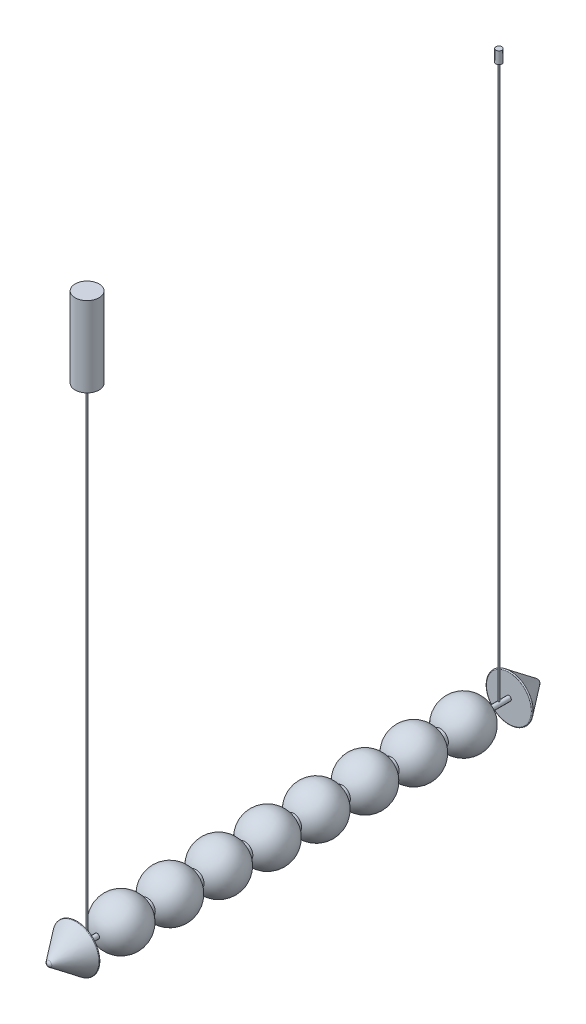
ISO-10303-21;
HEADER;
FILE_DESCRIPTION(('STEP AP214'),'2;1');
FILE_NAME('part.step','',(''),(''),'','','');
FILE_SCHEMA(('AUTOMOTIVE_DESIGN { 1 0 10303 214 1 1 1 1 }'));
ENDSEC;
DATA;
#1=APPLICATION_CONTEXT('core data for automotive mechanical design processes');
#2=APPLICATION_PROTOCOL_DEFINITION('international standard','automotive_design',2000,#1);
#3=PRODUCT_CONTEXT('',#1,'mechanical');
#4=PRODUCT('Part','Part','',(#3));
#5=PRODUCT_RELATED_PRODUCT_CATEGORY('part','',(#4));
#6=PRODUCT_DEFINITION_FORMATION('','',#4);
#7=PRODUCT_DEFINITION_CONTEXT('part definition',#1,'design');
#8=PRODUCT_DEFINITION('design','',#6,#7);
#9=PRODUCT_DEFINITION_SHAPE('','',#8);
#10=(LENGTH_UNIT() NAMED_UNIT(*) SI_UNIT(.MILLI.,.METRE.));
#11=(NAMED_UNIT(*) PLANE_ANGLE_UNIT() SI_UNIT($,.RADIAN.));
#12=(NAMED_UNIT(*) SI_UNIT($,.STERADIAN.) SOLID_ANGLE_UNIT());
#13=UNCERTAINTY_MEASURE_WITH_UNIT(LENGTH_MEASURE(1.E-05),#10,'distance_accuracy_value','');
#14=(GEOMETRIC_REPRESENTATION_CONTEXT(3) GLOBAL_UNCERTAINTY_ASSIGNED_CONTEXT((#13)) GLOBAL_UNIT_ASSIGNED_CONTEXT((#10,
#11,#12)) REPRESENTATION_CONTEXT('',''));
#15=CARTESIAN_POINT('',(0.,0.,0.));
#16=DIRECTION('',(0.,0.,1.));
#17=DIRECTION('',(1.,0.,0.));
#18=AXIS2_PLACEMENT_3D('',#15,#16,#17);
#19=CARTESIAN_POINT('',(0.,1420.,-1055.));
#20=DIRECTION('',(0.,-1.,0.));
#21=DIRECTION('',(0.,0.,-1.));
#22=AXIS2_PLACEMENT_3D('',#19,#20,#21);
#23=CYLINDRICAL_SURFACE('',#22,7.49999999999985);
#24=CARTESIAN_POINT('',(0.,1420.,-1055.));
#25=DIRECTION('',(0.,1.,0.));
#26=DIRECTION('',(0.,0.,1.));
#27=AXIS2_PLACEMENT_3D('',#24,#25,#26);
#28=CIRCLE('',#27,7.49999999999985);
#29=CARTESIAN_POINT('',(0.,1420.,-1047.5));
#30=VERTEX_POINT('',#29);
#31=EDGE_CURVE('E11',#30,#30,#28,.T.);
#32=ORIENTED_EDGE('',*,*,#31,.F.);
#33=EDGE_LOOP('',(#32));
#34=FACE_BOUND('',#33,.T.);
#35=CARTESIAN_POINT('',(0.,1390.,-1055.));
#36=DIRECTION('',(0.,1.,0.));
#37=DIRECTION('',(0.,0.,1.));
#38=AXIS2_PLACEMENT_3D('',#35,#36,#37);
#39=CIRCLE('',#38,7.49999999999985);
#40=CARTESIAN_POINT('',(0.,1390.,-1047.5));
#41=VERTEX_POINT('',#40);
#42=EDGE_CURVE('E42',#41,#41,#39,.T.);
#43=ORIENTED_EDGE('',*,*,#42,.T.);
#44=EDGE_LOOP('',(#43));
#45=FACE_BOUND('',#44,.T.);
#46=ADVANCED_FACE('F39',(#34,#45),#23,.T.);
#47=CARTESIAN_POINT('',(0.,1420.,-1055.));
#48=DIRECTION('',(0.,1.,0.));
#49=DIRECTION('',(0.,0.,1.));
#50=AXIS2_PLACEMENT_3D('',#47,#48,#49);
#51=PLANE('',#50);
#52=ORIENTED_EDGE('',*,*,#31,.T.);
#53=EDGE_LOOP('',(#52));
#54=FACE_BOUND('',#53,.T.);
#55=ADVANCED_FACE('F54',(#54),#51,.T.);
#56=CARTESIAN_POINT('',(0.,1390.,-1055.));
#57=DIRECTION('',(0.,1.,0.));
#58=DIRECTION('',(0.,0.,1.));
#59=AXIS2_PLACEMENT_3D('',#56,#57,#58);
#60=PLANE('',#59);
#61=ORIENTED_EDGE('',*,*,#42,.F.);
#62=EDGE_LOOP('',(#61));
#63=FACE_BOUND('',#62,.T.);
#64=ADVANCED_FACE('F52',(#63),#60,.F.);
#65=CLOSED_SHELL('',(#46,#55,#64));
#66=MANIFOLD_SOLID_BREP('B2',#65);
#67=CARTESIAN_POINT('',(0.,1410.,-25.));
#68=DIRECTION('',(0.,-1.,0.));
#69=DIRECTION('',(0.,0.,-1.));
#70=AXIS2_PLACEMENT_3D('',#67,#68,#69);
#71=CYLINDRICAL_SURFACE('',#70,30.);
#72=CARTESIAN_POINT('',(0.,1410.,-25.));
#73=DIRECTION('',(0.,1.,0.));
#74=DIRECTION('',(0.,0.,1.));
#75=AXIS2_PLACEMENT_3D('',#72,#73,#74);
#76=CIRCLE('',#75,30.);
#77=CARTESIAN_POINT('',(0.,1410.,5.));
#78=VERTEX_POINT('',#77);
#79=EDGE_CURVE('E38',#78,#78,#76,.T.);
#80=ORIENTED_EDGE('',*,*,#79,.F.);
#81=EDGE_LOOP('',(#80));
#82=FACE_BOUND('',#81,.T.);
#83=CARTESIAN_POINT('',(0.,1210.,-25.));
#84=DIRECTION('',(0.,1.,0.));
#85=DIRECTION('',(0.,0.,1.));
#86=AXIS2_PLACEMENT_3D('',#83,#84,#85);
#87=CIRCLE('',#86,30.);
#88=CARTESIAN_POINT('',(0.,1210.,5.));
#89=VERTEX_POINT('',#88);
#90=EDGE_CURVE('E90',#89,#89,#87,.T.);
#91=ORIENTED_EDGE('',*,*,#90,.T.);
#92=EDGE_LOOP('',(#91));
#93=FACE_BOUND('',#92,.T.);
#94=ADVANCED_FACE('F87',(#82,#93),#71,.T.);
#95=CARTESIAN_POINT('',(0.,1410.,-25.));
#96=DIRECTION('',(0.,1.,0.));
#97=DIRECTION('',(0.,0.,1.));
#98=AXIS2_PLACEMENT_3D('',#95,#96,#97);
#99=PLANE('',#98);
#100=ORIENTED_EDGE('',*,*,#79,.T.);
#101=EDGE_LOOP('',(#100));
#102=FACE_BOUND('',#101,.T.);
#103=ADVANCED_FACE('F102',(#102),#99,.T.);
#104=CARTESIAN_POINT('',(0.,1210.,-25.));
#105=DIRECTION('',(0.,1.,0.));
#106=DIRECTION('',(0.,0.,1.));
#107=AXIS2_PLACEMENT_3D('',#104,#105,#106);
#108=PLANE('',#107);
#109=ORIENTED_EDGE('',*,*,#90,.F.);
#110=EDGE_LOOP('',(#109));
#111=FACE_BOUND('',#110,.T.);
#112=ADVANCED_FACE('F100',(#111),#108,.F.);
#113=CLOSED_SHELL('',(#94,#103,#112));
#114=MANIFOLD_SOLID_BREP('B6',#113);
#115=CARTESIAN_POINT('',(0.,1210.,-25.));
#116=DIRECTION('',(0.,-1.,0.));
#117=DIRECTION('',(0.,0.,-1.));
#118=AXIS2_PLACEMENT_3D('',#115,#116,#117);
#119=CYLINDRICAL_SURFACE('',#118,5.);
#120=CARTESIAN_POINT('',(0.,1210.,-25.));
#121=DIRECTION('',(0.,1.,0.));
#122=DIRECTION('',(0.,0.,1.));
#123=AXIS2_PLACEMENT_3D('',#120,#121,#122);
#124=CIRCLE('',#123,5.);
#125=CARTESIAN_POINT('',(0.,1210.,-20.));
#126=VERTEX_POINT('',#125);
#127=EDGE_CURVE('E86',#126,#126,#124,.T.);
#128=ORIENTED_EDGE('',*,*,#127,.F.);
#129=EDGE_LOOP('',(#128));
#130=FACE_BOUND('',#129,.T.);
#131=CARTESIAN_POINT('',(0.,1200.,-25.));
#132=DIRECTION('',(0.,1.,0.));
#133=DIRECTION('',(0.,0.,1.));
#134=AXIS2_PLACEMENT_3D('',#131,#132,#133);
#135=CIRCLE('',#134,5.);
#136=CARTESIAN_POINT('',(0.,1200.,-20.));
#137=VERTEX_POINT('',#136);
#138=EDGE_CURVE('E138',#137,#137,#135,.T.);
#139=ORIENTED_EDGE('',*,*,#138,.T.);
#140=EDGE_LOOP('',(#139));
#141=FACE_BOUND('',#140,.T.);
#142=ADVANCED_FACE('F135',(#130,#141),#119,.T.);
#143=CARTESIAN_POINT('',(0.,1210.,-25.));
#144=DIRECTION('',(0.,1.,0.));
#145=DIRECTION('',(0.,0.,1.));
#146=AXIS2_PLACEMENT_3D('',#143,#144,#145);
#147=PLANE('',#146);
#148=ORIENTED_EDGE('',*,*,#127,.T.);
#149=EDGE_LOOP('',(#148));
#150=FACE_BOUND('',#149,.T.);
#151=ADVANCED_FACE('F150',(#150),#147,.T.);
#152=CARTESIAN_POINT('',(0.,1200.,-25.));
#153=DIRECTION('',(0.,1.,0.));
#154=DIRECTION('',(0.,0.,1.));
#155=AXIS2_PLACEMENT_3D('',#152,#153,#154);
#156=PLANE('',#155);
#157=ORIENTED_EDGE('',*,*,#138,.F.);
#158=EDGE_LOOP('',(#157));
#159=FACE_BOUND('',#158,.T.);
#160=ADVANCED_FACE('F148',(#159),#156,.F.);
#161=CLOSED_SHELL('',(#142,#151,#160));
#162=MANIFOLD_SOLID_BREP('B33',#161);
#163=CARTESIAN_POINT('',(0.,1390.,-1055.));
#164=DIRECTION('',(0.,-1.,0.));
#165=DIRECTION('',(0.,0.,-1.));
#166=AXIS2_PLACEMENT_3D('',#163,#164,#165);
#167=CYLINDRICAL_SURFACE('',#166,1.49999999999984);
#168=CARTESIAN_POINT('',(0.,1390.,-1055.));
#169=DIRECTION('',(0.,1.,0.));
#170=DIRECTION('',(0.,0.,1.));
#171=AXIS2_PLACEMENT_3D('',#168,#169,#170);
#172=CIRCLE('',#171,1.49999999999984);
#173=CARTESIAN_POINT('',(0.,1390.,-1053.5));
#174=VERTEX_POINT('',#173);
#175=EDGE_CURVE('E134',#174,#174,#172,.T.);
#176=ORIENTED_EDGE('',*,*,#175,.F.);
#177=EDGE_LOOP('',(#176));
#178=FACE_BOUND('',#177,.T.);
#179=CARTESIAN_POINT('',(0.,0.,-1055.));
#180=DIRECTION('',(0.,1.,0.));
#181=DIRECTION('',(0.,0.,1.));
#182=AXIS2_PLACEMENT_3D('',#179,#180,#181);
#183=CIRCLE('',#182,1.49999999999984);
#184=CARTESIAN_POINT('',(0.,0.,-1053.5));
#185=VERTEX_POINT('',#184);
#186=EDGE_CURVE('E186',#185,#185,#183,.T.);
#187=ORIENTED_EDGE('',*,*,#186,.T.);
#188=EDGE_LOOP('',(#187));
#189=FACE_BOUND('',#188,.T.);
#190=ADVANCED_FACE('F183',(#178,#189),#167,.T.);
#191=CARTESIAN_POINT('',(0.,1390.,-1055.));
#192=DIRECTION('',(0.,1.,0.));
#193=DIRECTION('',(0.,0.,1.));
#194=AXIS2_PLACEMENT_3D('',#191,#192,#193);
#195=PLANE('',#194);
#196=ORIENTED_EDGE('',*,*,#175,.T.);
#197=EDGE_LOOP('',(#196));
#198=FACE_BOUND('',#197,.T.);
#199=ADVANCED_FACE('F198',(#198),#195,.T.);
#200=CARTESIAN_POINT('',(0.,0.,-1055.));
#201=DIRECTION('',(0.,1.,0.));
#202=DIRECTION('',(0.,0.,1.));
#203=AXIS2_PLACEMENT_3D('',#200,#201,#202);
#204=PLANE('',#203);
#205=ORIENTED_EDGE('',*,*,#186,.F.);
#206=EDGE_LOOP('',(#205));
#207=FACE_BOUND('',#206,.T.);
#208=ADVANCED_FACE('F196',(#207),#204,.F.);
#209=CLOSED_SHELL('',(#190,#199,#208));
#210=MANIFOLD_SOLID_BREP('B81',#209);
#211=CARTESIAN_POINT('',(0.,1200.,-25.));
#212=DIRECTION('',(0.,-1.,0.));
#213=DIRECTION('',(0.,0.,-1.));
#214=AXIS2_PLACEMENT_3D('',#211,#212,#213);
#215=CYLINDRICAL_SURFACE('',#214,1.5);
#216=CARTESIAN_POINT('',(0.,1200.,-25.));
#217=DIRECTION('',(0.,1.,0.));
#218=DIRECTION('',(0.,0.,1.));
#219=AXIS2_PLACEMENT_3D('',#216,#217,#218);
#220=CIRCLE('',#219,1.5);
#221=CARTESIAN_POINT('',(0.,1200.,-23.5));
#222=VERTEX_POINT('',#221);
#223=EDGE_CURVE('E182',#222,#222,#220,.T.);
#224=ORIENTED_EDGE('',*,*,#223,.F.);
#225=EDGE_LOOP('',(#224));
#226=FACE_BOUND('',#225,.T.);
#227=CARTESIAN_POINT('',(0.,0.,-25.));
#228=DIRECTION('',(0.,1.,0.));
#229=DIRECTION('',(0.,0.,1.));
#230=AXIS2_PLACEMENT_3D('',#227,#228,#229);
#231=CIRCLE('',#230,1.5);
#232=CARTESIAN_POINT('',(0.,0.,-23.5));
#233=VERTEX_POINT('',#232);
#234=EDGE_CURVE('E236',#233,#233,#231,.T.);
#235=ORIENTED_EDGE('',*,*,#234,.T.);
#236=EDGE_LOOP('',(#235));
#237=FACE_BOUND('',#236,.T.);
#238=ADVANCED_FACE('F233',(#226,#237),#215,.T.);
#239=CARTESIAN_POINT('',(0.,1200.,-25.));
#240=DIRECTION('',(0.,1.,0.));
#241=DIRECTION('',(0.,0.,1.));
#242=AXIS2_PLACEMENT_3D('',#239,#240,#241);
#243=PLANE('',#242);
#244=ORIENTED_EDGE('',*,*,#223,.T.);
#245=EDGE_LOOP('',(#244));
#246=FACE_BOUND('',#245,.T.);
#247=ADVANCED_FACE('F248',(#246),#243,.T.);
#248=CARTESIAN_POINT('',(0.,0.,-25.));
#249=DIRECTION('',(0.,1.,0.));
#250=DIRECTION('',(0.,0.,1.));
#251=AXIS2_PLACEMENT_3D('',#248,#249,#250);
#252=PLANE('',#251);
#253=ORIENTED_EDGE('',*,*,#234,.F.);
#254=EDGE_LOOP('',(#253));
#255=FACE_BOUND('',#254,.T.);
#256=ADVANCED_FACE('F246',(#255),#252,.F.);
#257=CLOSED_SHELL('',(#238,#247,#256));
#258=MANIFOLD_SOLID_BREP('B129',#257);
#259=CARTESIAN_POINT('',(-1.32261854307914E-13,0.,-1080.));
#260=DIRECTION('',(0.,0.,1.));
#261=DIRECTION('',(-1.,0.,0.));
#262=AXIS2_PLACEMENT_3D('',#259,#260,#261);
#263=PLANE('',#262);
#264=CARTESIAN_POINT('',(-1.32261854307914E-13,0.,-1080.));
#265=DIRECTION('',(0.,0.,1.));
#266=DIRECTION('',(1.,0.,0.));
#267=AXIS2_PLACEMENT_3D('',#264,#265,#266);
#268=CIRCLE('',#267,55.9999999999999);
#269=CARTESIAN_POINT('',(55.9999999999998,0.,-1080.));
#270=VERTEX_POINT('',#269);
#271=EDGE_CURVE('E231',#270,#270,#268,.T.);
#272=ORIENTED_EDGE('',*,*,#271,.T.);
#273=EDGE_LOOP('',(#272));
#274=FACE_BOUND('',#273,.T.);
#275=ADVANCED_FACE('F283',(#274),#263,.T.);
#276=CARTESIAN_POINT('',(-1.32261854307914E-13,0.,-1080.));
#277=DIRECTION('',(0.,0.,1.));
#278=DIRECTION('',(-1.,0.,0.));
#279=AXIS2_PLACEMENT_3D('',#276,#277,#278);
#280=CONICAL_SURFACE('',#279,60.,0.643501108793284);
#281=CARTESIAN_POINT('',(-1.32653741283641E-13,0.,-1083.2));
#282=DIRECTION('',(0.,0.,-1.));
#283=DIRECTION('',(-1.,0.,0.));
#284=AXIS2_PLACEMENT_3D('',#281,#282,#283);
#285=CIRCLE('',#284,57.6);
#286=CARTESIAN_POINT('',(-57.6000000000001,0.,-1083.2));
#287=VERTEX_POINT('',#286);
#288=EDGE_CURVE('E290',#287,#287,#285,.T.);
#289=CARTESIAN_POINT('',(-1.40893006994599E-13,0.,-1150.47871021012));
#290=DIRECTION('',(0.,0.,-1.));
#291=DIRECTION('',(-1.,0.,0.));
#292=AXIS2_PLACEMENT_3D('',#289,#290,#291);
#293=CIRCLE('',#292,7.14096734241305);
#294=CARTESIAN_POINT('',(-7.14096734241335,0.,-1150.47871021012));
#295=VERTEX_POINT('',#294);
#296=EDGE_CURVE('E300',#295,#295,#293,.T.);
#297=CARTESIAN_POINT('',(-57.6000000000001,0.,-1083.2));
#298=CARTESIAN_POINT('',(-57.0743850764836,0.,-1083.90081989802));
#299=CARTESIAN_POINT('',(-56.5487701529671,0.,-1084.60163979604));
#300=CARTESIAN_POINT('',(-55.497540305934,0.,-1086.00327959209));
#301=CARTESIAN_POINT('',(-54.9719253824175,0.,-1086.70409949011));
#302=CARTESIAN_POINT('',(-53.9206955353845,0.,-1088.10573928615));
#303=CARTESIAN_POINT('',(-53.3950806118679,0.,-1088.80655918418));
#304=CARTESIAN_POINT('',(-52.3438507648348,0.,-1090.20819898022));
#305=CARTESIAN_POINT('',(-51.8182358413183,0.,-1090.90901887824));
#306=CARTESIAN_POINT('',(-50.7670059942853,0.,-1092.31065867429));
#307=CARTESIAN_POINT('',(-50.2413910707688,0.,-1093.01147857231));
#308=CARTESIAN_POINT('',(-49.1901612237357,0.,-1094.41311836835));
#309=CARTESIAN_POINT('',(-48.6645463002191,0.,-1095.11393826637));
#310=CARTESIAN_POINT('',(-47.6133164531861,0.,-1096.51557806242));
#311=CARTESIAN_POINT('',(-47.0877015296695,0.,-1097.21639796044));
#312=CARTESIAN_POINT('',(-46.0364716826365,0.,-1098.61803775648));
#313=CARTESIAN_POINT('',(-45.51085675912,0.,-1099.31885765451));
#314=CARTESIAN_POINT('',(-44.4596269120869,0.,-1100.72049745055));
#315=CARTESIAN_POINT('',(-43.9340119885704,0.,-1101.42131734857));
#316=CARTESIAN_POINT('',(-42.8827821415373,0.,-1102.82295714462));
#317=CARTESIAN_POINT('',(-42.3571672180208,0.,-1103.52377704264));
#318=CARTESIAN_POINT('',(-41.3059373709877,0.,-1104.92541683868));
#319=CARTESIAN_POINT('',(-40.7803224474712,0.,-1105.62623673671));
#320=CARTESIAN_POINT('',(-39.7290926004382,0.,-1107.02787653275));
#321=CARTESIAN_POINT('',(-39.2034776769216,0.,-1107.72869643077));
#322=CARTESIAN_POINT('',(-38.1522478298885,0.,-1109.13033622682));
#323=CARTESIAN_POINT('',(-37.626632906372,0.,-1109.83115612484));
#324=CARTESIAN_POINT('',(-36.575403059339,0.,-1111.23279592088));
#325=CARTESIAN_POINT('',(-36.0497881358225,0.,-1111.9336158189));
#326=CARTESIAN_POINT('',(-34.9985582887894,0.,-1113.33525561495));
#327=CARTESIAN_POINT('',(-34.4729433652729,0.,-1114.03607551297));
#328=CARTESIAN_POINT('',(-33.4217135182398,0.,-1115.43771530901));
#329=CARTESIAN_POINT('',(-32.8960985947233,0.,-1116.13853520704));
#330=CARTESIAN_POINT('',(-31.8448687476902,0.,-1117.54017500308));
#331=CARTESIAN_POINT('',(-31.3192538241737,0.,-1118.2409949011));
#332=CARTESIAN_POINT('',(-30.2680239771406,0.,-1119.64263469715));
#333=CARTESIAN_POINT('',(-29.7424090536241,0.,-1120.34345459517));
#334=CARTESIAN_POINT('',(-28.691179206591,0.,-1121.74509439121));
#335=CARTESIAN_POINT('',(-28.1655642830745,0.,-1122.44591428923));
#336=CARTESIAN_POINT('',(-27.1143344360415,0.,-1123.84755408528));
#337=CARTESIAN_POINT('',(-26.588719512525,0.,-1124.5483739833));
#338=CARTESIAN_POINT('',(-25.5374896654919,0.,-1125.95001377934));
#339=CARTESIAN_POINT('',(-25.0118747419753,0.,-1126.65083367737));
#340=CARTESIAN_POINT('',(-23.9606448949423,0.,-1128.05247347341));
#341=CARTESIAN_POINT('',(-23.4350299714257,0.,-1128.75329337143));
#342=CARTESIAN_POINT('',(-22.3838001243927,0.,-1130.15493316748));
#343=CARTESIAN_POINT('',(-21.8581852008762,0.,-1130.8557530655));
#344=CARTESIAN_POINT('',(-20.8069553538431,0.,-1132.25739286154));
#345=CARTESIAN_POINT('',(-20.2813404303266,0.,-1132.95821275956));
#346=CARTESIAN_POINT('',(-19.2301105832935,0.,-1134.35985255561));
#347=CARTESIAN_POINT('',(-18.704495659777,0.,-1135.06067245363));
#348=CARTESIAN_POINT('',(-17.6532658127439,0.,-1136.46231224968));
#349=CARTESIAN_POINT('',(-17.1276508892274,0.,-1137.1631321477));
#350=CARTESIAN_POINT('',(-16.0764210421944,0.,-1138.56477194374));
#351=CARTESIAN_POINT('',(-15.5508061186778,0.,-1139.26559184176));
#352=CARTESIAN_POINT('',(-14.4995762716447,0.,-1140.66723163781));
#353=CARTESIAN_POINT('',(-13.9739613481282,0.,-1141.36805153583));
#354=CARTESIAN_POINT('',(-12.9227315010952,0.,-1142.76969133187));
#355=CARTESIAN_POINT('',(-12.3971165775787,0.,-1143.4705112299));
#356=CARTESIAN_POINT('',(-11.3458867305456,0.,-1144.87215102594));
#357=CARTESIAN_POINT('',(-10.820271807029,0.,-1145.57297092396));
#358=CARTESIAN_POINT('',(-9.76904195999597,0.,-1146.97461072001));
#359=CARTESIAN_POINT('',(-9.24342703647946,0.,-1147.67543061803));
#360=CARTESIAN_POINT('',(-8.19219718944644,0.,-1149.07707041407));
#361=CARTESIAN_POINT('',(-7.66658226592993,0.,-1149.77789031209));
#362=CARTESIAN_POINT('',(-7.14096734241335,0.,-1150.47871021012));
#363=B_SPLINE_CURVE_WITH_KNOTS('',3,(#297,#298,#299,#300,#301,#302,#303,#304,#305,#306,#307,
#308,#309,#310,#311,#312,#313,#314,#315,#316,#317,#318,#319,#320,#321,#322,#323,#324,#325,#326,
#327,#328,#329,#330,#331,#332,#333,#334,#335,#336,#337,#338,#339,#340,#341,#342,#343,#344,#345,
#346,#347,#348,#349,#350,#351,#352,#353,#354,#355,#356,#357,#358,#359,#360,#361,#362),
.UNSPECIFIED.,.F.,.F.,(4,2,2,2,2,2,2,2,2,2,2,2,2,2,2,2,2,2,2,2,2,2,2,2,2,2,2,2,2,2,2,2,4),(0.,
2.62807461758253,5.25614923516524,7.88422385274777,10.5122984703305,13.1403730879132,
15.7684477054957,18.3965223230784,21.0245969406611,23.6526715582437,26.2807461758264,
28.9088207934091,31.5368954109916,34.1649700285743,36.793044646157,39.4211192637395,
42.0491938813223,44.677268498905,47.3053431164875,49.9334177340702,52.5614923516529,
55.1895669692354,57.8176415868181,60.4457162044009,63.0737908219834,65.7018654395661,
68.3299400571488,70.9580146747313,73.5860892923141,76.2141639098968,78.8422385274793,
81.470313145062,84.0983877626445),.UNSPECIFIED.);
#364=EDGE_CURVE('BSEAM296',#287,#295,#363,.T.);
#365=ORIENTED_EDGE('',*,*,#288,.T.);
#366=ORIENTED_EDGE('',*,*,#296,.F.);
#367=ORIENTED_EDGE('',*,*,#364,.T.);
#368=ORIENTED_EDGE('',*,*,#364,.F.);
#369=EDGE_LOOP('',(#365,#367,#366,#368));
#370=FACE_BOUND('',#369,.T.);
#371=ADVANCED_FACE('F296',(#370),#280,.T.);
#372=CARTESIAN_POINT('',(0.714502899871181,0.,-1144.5871075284));
#373=DIRECTION('',(0.,1.,0.));
#374=DIRECTION('',(-1.,0.,0.));
#375=AXIS2_PLACEMENT_3D('',#372,#373,#374);
#376=CIRCLE('',#375,9.81933780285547);
#377=TRIMMED_CURVE('',#376,(PARAMETER_VALUE(-1.49796708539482)),
(PARAMETER_VALUE(1.49796708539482)),.T.,.PARAMETER.);
#378=CARTESIAN_POINT('',(-1.40166457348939E-13,0.,-1144.5871075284));
#379=DIRECTION('',(0.,0.,1.));
#380=AXIS1_PLACEMENT('',#378,#379);
#381=SURFACE_OF_REVOLUTION('',#377,#380);
#382=CARTESIAN_POINT('',(-1.48745078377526E-13,0.,-1154.38041547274));
#383=VERTEX_POINT('',#382);
#384=VERTEX_LOOP('',#383);
#385=FACE_BOUND('',#384,.T.);
#386=ORIENTED_EDGE('',*,*,#296,.T.);
#387=EDGE_LOOP('',(#386));
#388=FACE_BOUND('',#387,.T.);
#389=ADVANCED_FACE('F293',(#385,#388),#381,.T.);
#390=CARTESIAN_POINT('',(-1.32506783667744E-13,0.,-1082.));
#391=DIRECTION('',(0.,0.,1.));
#392=DIRECTION('',(1.,0.,0.));
#393=AXIS2_PLACEMENT_3D('',#390,#391,#392);
#394=TOROIDAL_SURFACE('',#393,55.9999999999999,2.);
#395=ORIENTED_EDGE('',*,*,#271,.F.);
#396=EDGE_LOOP('',(#395));
#397=FACE_BOUND('',#396,.T.);
#398=ORIENTED_EDGE('',*,*,#288,.F.);
#399=EDGE_LOOP('',(#398));
#400=FACE_BOUND('',#399,.T.);
#401=ADVANCED_FACE('F285',(#397,#400),#394,.T.);
#402=CLOSED_SHELL('',(#275,#371,#389,#401));
#403=MANIFOLD_SOLID_BREP('B177',#402);
#404=CARTESIAN_POINT('',(0.,0.,0.));
#405=DIRECTION('',(0.,0.,-1.));
#406=DIRECTION('',(-1.,0.,0.));
#407=AXIS2_PLACEMENT_3D('',#404,#405,#406);
#408=PLANE('',#407);
#409=CARTESIAN_POINT('',(0.,0.,0.));
#410=DIRECTION('',(0.,0.,-1.));
#411=DIRECTION('',(-1.,0.,0.));
#412=AXIS2_PLACEMENT_3D('',#409,#410,#411);
#413=CIRCLE('',#412,56.);
#414=CARTESIAN_POINT('',(-56.,0.,0.));
#415=VERTEX_POINT('',#414);
#416=EDGE_CURVE('E355',#415,#415,#413,.T.);
#417=ORIENTED_EDGE('',*,*,#416,.T.);
#418=EDGE_LOOP('',(#417));
#419=FACE_BOUND('',#418,.T.);
#420=ADVANCED_FACE('F348',(#419),#408,.T.);
#421=CARTESIAN_POINT('',(0.,0.,0.));
#422=DIRECTION('',(0.,0.,-1.));
#423=DIRECTION('',(-1.,0.,0.));
#424=AXIS2_PLACEMENT_3D('',#421,#422,#423);
#425=CONICAL_SURFACE('',#424,60.,0.643501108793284);
#426=CARTESIAN_POINT('',(0.,0.,3.19999999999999));
#427=DIRECTION('',(0.,0.,1.));
#428=DIRECTION('',(1.,0.,0.));
#429=AXIS2_PLACEMENT_3D('',#426,#427,#428);
#430=CIRCLE('',#429,57.6);
#431=CARTESIAN_POINT('',(-57.6,0.,3.2));
#432=VERTEX_POINT('',#431);
#433=EDGE_CURVE('E281',#432,#432,#430,.T.);
#434=CARTESIAN_POINT('',(0.,0.,70.4787102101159));
#435=DIRECTION('',(0.,0.,-1.));
#436=DIRECTION('',(-1.,0.,0.));
#437=AXIS2_PLACEMENT_3D('',#434,#435,#436);
#438=CIRCLE('',#437,7.14096734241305);
#439=CARTESIAN_POINT('',(-7.14096734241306,0.,70.4787102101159));
#440=VERTEX_POINT('',#439);
#441=EDGE_CURVE('E365',#440,#440,#438,.T.);
#442=CARTESIAN_POINT('',(-57.6,0.,3.2));
#443=CARTESIAN_POINT('',(-57.0743850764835,0.,3.90081989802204));
#444=CARTESIAN_POINT('',(-56.5487701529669,0.,4.60163979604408));
#445=CARTESIAN_POINT('',(-55.4975403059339,0.,6.00327959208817));
#446=CARTESIAN_POINT('',(-54.9719253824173,0.,6.70409949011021));
#447=CARTESIAN_POINT('',(-53.9206955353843,0.,8.10573928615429));
#448=CARTESIAN_POINT('',(-53.3950806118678,0.,8.80655918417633));
#449=CARTESIAN_POINT('',(-52.3438507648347,0.,10.2081989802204));
#450=CARTESIAN_POINT('',(-51.8182358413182,0.,10.9090188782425));
#451=CARTESIAN_POINT('',(-50.7670059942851,0.,12.3106586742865));
#452=CARTESIAN_POINT('',(-50.2413910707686,0.,13.0114785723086));
#453=CARTESIAN_POINT('',(-49.1901612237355,0.,14.4131183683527));
#454=CARTESIAN_POINT('',(-48.664546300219,0.,15.1139382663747));
#455=CARTESIAN_POINT('',(-47.6133164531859,0.,16.5155780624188));
#456=CARTESIAN_POINT('',(-47.0877015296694,0.,17.2163979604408));
#457=CARTESIAN_POINT('',(-46.0364716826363,0.,18.6180377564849));
#458=CARTESIAN_POINT('',(-45.5108567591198,0.,19.3188576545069));
#459=CARTESIAN_POINT('',(-44.4596269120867,0.,20.720497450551));
#460=CARTESIAN_POINT('',(-43.9340119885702,0.,21.4213173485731));
#461=CARTESIAN_POINT('',(-42.8827821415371,0.,22.8229571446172));
#462=CARTESIAN_POINT('',(-42.3571672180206,0.,23.5237770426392));
#463=CARTESIAN_POINT('',(-41.3059373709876,0.,24.9254168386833));
#464=CARTESIAN_POINT('',(-40.780322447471,0.,25.6262367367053));
#465=CARTESIAN_POINT('',(-39.729092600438,0.,27.0278765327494));
#466=CARTESIAN_POINT('',(-39.2034776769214,0.,27.7286964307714));
#467=CARTESIAN_POINT('',(-38.1522478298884,0.,29.1303362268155));
#468=CARTESIAN_POINT('',(-37.6266329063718,0.,29.8311561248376));
#469=CARTESIAN_POINT('',(-36.5754030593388,0.,31.2327959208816));
#470=CARTESIAN_POINT('',(-36.0497881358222,0.,31.9336158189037));
#471=CARTESIAN_POINT('',(-34.9985582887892,0.,33.3352556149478));
#472=CARTESIAN_POINT('',(-34.4729433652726,0.,34.0360755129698));
#473=CARTESIAN_POINT('',(-33.4217135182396,0.,35.4377153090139));
#474=CARTESIAN_POINT('',(-32.8960985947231,0.,36.1385352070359));
#475=CARTESIAN_POINT('',(-31.84486874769,0.,37.54017500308));
#476=CARTESIAN_POINT('',(-31.3192538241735,0.,38.2409949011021));
#477=CARTESIAN_POINT('',(-30.2680239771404,0.,39.6426346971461));
#478=CARTESIAN_POINT('',(-29.7424090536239,0.,40.3434545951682));
#479=CARTESIAN_POINT('',(-28.6911792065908,0.,41.7450943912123));
#480=CARTESIAN_POINT('',(-28.1655642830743,0.,42.4459142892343));
#481=CARTESIAN_POINT('',(-27.1143344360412,0.,43.8475540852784));
#482=CARTESIAN_POINT('',(-26.5887195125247,0.,44.5483739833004));
#483=CARTESIAN_POINT('',(-25.5374896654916,0.,45.9500137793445));
#484=CARTESIAN_POINT('',(-25.0118747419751,0.,46.6508336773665));
#485=CARTESIAN_POINT('',(-23.960644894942,0.,48.0524734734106));
#486=CARTESIAN_POINT('',(-23.4350299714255,0.,48.7532933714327));
#487=CARTESIAN_POINT('',(-22.3838001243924,0.,50.1549331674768));
#488=CARTESIAN_POINT('',(-21.8581852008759,0.,50.8557530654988));
#489=CARTESIAN_POINT('',(-20.8069553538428,0.,52.2573928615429));
#490=CARTESIAN_POINT('',(-20.2813404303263,0.,52.9582127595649));
#491=CARTESIAN_POINT('',(-19.2301105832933,0.,54.359852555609));
#492=CARTESIAN_POINT('',(-18.7044956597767,0.,55.060672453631));
#493=CARTESIAN_POINT('',(-17.6532658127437,0.,56.4623122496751));
#494=CARTESIAN_POINT('',(-17.1276508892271,0.,57.1631321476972));
#495=CARTESIAN_POINT('',(-16.0764210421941,0.,58.5647719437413));
#496=CARTESIAN_POINT('',(-15.5508061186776,0.,59.2655918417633));
#497=CARTESIAN_POINT('',(-14.4995762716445,0.,60.6672316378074));
#498=CARTESIAN_POINT('',(-13.973961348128,0.,61.3680515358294));
#499=CARTESIAN_POINT('',(-12.9227315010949,0.,62.7696913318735));
#500=CARTESIAN_POINT('',(-12.3971165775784,0.,63.4705112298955));
#501=CARTESIAN_POINT('',(-11.3458867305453,0.,64.8721510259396));
#502=CARTESIAN_POINT('',(-10.8202718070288,0.,65.5729709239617));
#503=CARTESIAN_POINT('',(-9.76904195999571,0.,66.9746107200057));
#504=CARTESIAN_POINT('',(-9.24342703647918,0.,67.6754306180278));
#505=CARTESIAN_POINT('',(-8.19219718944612,0.,69.0770704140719));
#506=CARTESIAN_POINT('',(-7.66658226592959,0.,69.7778903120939));
#507=CARTESIAN_POINT('',(-7.14096734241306,0.,70.4787102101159));
#508=B_SPLINE_CURVE_WITH_KNOTS('',3,(#442,#443,#444,#445,#446,#447,#448,#449,#450,#451,#452,
#453,#454,#455,#456,#457,#458,#459,#460,#461,#462,#463,#464,#465,#466,#467,#468,#469,#470,#471,
#472,#473,#474,#475,#476,#477,#478,#479,#480,#481,#482,#483,#484,#485,#486,#487,#488,#489,#490,
#491,#492,#493,#494,#495,#496,#497,#498,#499,#500,#501,#502,#503,#504,#505,#506,#507),
.UNSPECIFIED.,.F.,.F.,(4,2,2,2,2,2,2,2,2,2,2,2,2,2,2,2,2,2,2,2,2,2,2,2,2,2,2,2,2,2,2,2,4),(0.,
2.62807461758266,5.25614923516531,7.88422385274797,10.5122984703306,13.1403730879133,
15.7684477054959,18.3965223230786,21.0245969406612,23.6526715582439,26.2807461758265,
28.9088207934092,31.5368954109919,34.1649700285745,36.7930446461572,39.4211192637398,
42.0491938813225,44.6772684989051,47.3053431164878,49.9334177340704,52.5614923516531,
55.1895669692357,57.8176415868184,60.4457162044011,63.0737908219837,65.7018654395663,
68.329940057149,70.9580146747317,73.5860892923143,76.214163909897,78.8422385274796,
81.4703131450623,84.0983877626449),.UNSPECIFIED.);
#509=EDGE_CURVE('BSEAM361',#432,#440,#508,.T.);
#510=ORIENTED_EDGE('',*,*,#433,.T.);
#511=ORIENTED_EDGE('',*,*,#441,.T.);
#512=ORIENTED_EDGE('',*,*,#509,.T.);
#513=ORIENTED_EDGE('',*,*,#509,.F.);
#514=EDGE_LOOP('',(#510,#512,#511,#513));
#515=FACE_BOUND('',#514,.T.);
#516=ADVANCED_FACE('F361',(#515),#425,.T.);
#517=CARTESIAN_POINT('',(0.714502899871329,0.,64.5871075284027));
#518=DIRECTION('',(0.,-1.,0.));
#519=DIRECTION('',(-1.,0.,0.));
#520=AXIS2_PLACEMENT_3D('',#517,#518,#519);
#521=CIRCLE('',#520,9.81933780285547);
#522=TRIMMED_CURVE('',#521,(PARAMETER_VALUE(-1.49796708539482)),
(PARAMETER_VALUE(1.49796708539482)),.T.,.PARAMETER.);
#523=CARTESIAN_POINT('',(0.,0.,64.5871075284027));
#524=DIRECTION('',(0.,0.,-1.));
#525=AXIS1_PLACEMENT('',#523,#524);
#526=SURFACE_OF_REVOLUTION('',#522,#525);
#527=CARTESIAN_POINT('',(0.,0.,74.3804154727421));
#528=VERTEX_POINT('',#527);
#529=VERTEX_LOOP('',#528);
#530=FACE_BOUND('',#529,.T.);
#531=ORIENTED_EDGE('',*,*,#441,.F.);
#532=EDGE_LOOP('',(#531));
#533=FACE_BOUND('',#532,.T.);
#534=ADVANCED_FACE('F358',(#530,#533),#526,.T.);
#535=CARTESIAN_POINT('',(0.,0.,2.));
#536=DIRECTION('',(0.,0.,-1.));
#537=DIRECTION('',(-1.,0.,0.));
#538=AXIS2_PLACEMENT_3D('',#535,#536,#537);
#539=TOROIDAL_SURFACE('',#538,56.,2.);
#540=ORIENTED_EDGE('',*,*,#433,.F.);
#541=EDGE_LOOP('',(#540));
#542=FACE_BOUND('',#541,.T.);
#543=ORIENTED_EDGE('',*,*,#416,.F.);
#544=EDGE_LOOP('',(#543));
#545=FACE_BOUND('',#544,.T.);
#546=ADVANCED_FACE('F350',(#542,#545),#539,.T.);
#547=CLOSED_SHELL('',(#420,#516,#534,#546));
#548=MANIFOLD_SOLID_BREP('B225',#547);
#549=CARTESIAN_POINT('',(0.,0.,-1080.));
#550=DIRECTION('',(0.,0.,1.));
#551=DIRECTION('',(1.,0.,0.));
#552=AXIS2_PLACEMENT_3D('',#549,#550,#551);
#553=CYLINDRICAL_SURFACE('',#552,6.);
#554=CARTESIAN_POINT('',(0.,0.,-1080.));
#555=DIRECTION('',(0.,0.,1.));
#556=DIRECTION('',(1.,0.,0.));
#557=AXIS2_PLACEMENT_3D('',#554,#555,#556);
#558=CIRCLE('',#557,6.);
#559=CARTESIAN_POINT('',(6.,0.,-1080.));
#560=VERTEX_POINT('',#559);
#561=EDGE_CURVE('E347',#560,#560,#558,.T.);
#562=ORIENTED_EDGE('',*,*,#561,.T.);
#563=EDGE_LOOP('',(#562));
#564=FACE_BOUND('',#563,.T.);
#565=CARTESIAN_POINT('',(0.,0.,-1025.));
#566=DIRECTION('',(0.,0.,1.));
#567=DIRECTION('',(1.,0.,0.));
#568=AXIS2_PLACEMENT_3D('',#565,#566,#567);
#569=CIRCLE('',#568,6.);
#570=CARTESIAN_POINT('',(6.,0.,-1025.));
#571=VERTEX_POINT('',#570);
#572=EDGE_CURVE('E414',#571,#571,#569,.T.);
#573=ORIENTED_EDGE('',*,*,#572,.F.);
#574=EDGE_LOOP('',(#573));
#575=FACE_BOUND('',#574,.T.);
#576=ADVANCED_FACE('F411',(#564,#575),#553,.T.);
#577=CARTESIAN_POINT('',(0.,0.,-1080.));
#578=DIRECTION('',(0.,0.,1.));
#579=DIRECTION('',(1.,0.,0.));
#580=AXIS2_PLACEMENT_3D('',#577,#578,#579);
#581=PLANE('',#580);
#582=ORIENTED_EDGE('',*,*,#561,.F.);
#583=EDGE_LOOP('',(#582));
#584=FACE_BOUND('',#583,.T.);
#585=ADVANCED_FACE('F426',(#584),#581,.F.);
#586=CARTESIAN_POINT('',(0.,0.,-1025.));
#587=DIRECTION('',(0.,0.,1.));
#588=DIRECTION('',(1.,0.,0.));
#589=AXIS2_PLACEMENT_3D('',#586,#587,#588);
#590=PLANE('',#589);
#591=ORIENTED_EDGE('',*,*,#572,.T.);
#592=EDGE_LOOP('',(#591));
#593=FACE_BOUND('',#592,.T.);
#594=ADVANCED_FACE('F423',(#593),#590,.T.);
#595=CLOSED_SHELL('',(#576,#585,#594));
#596=MANIFOLD_SOLID_BREP('B275',#595);
#597=CARTESIAN_POINT('',(0.,0.,-966.134481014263));
#598=DIRECTION('',(0.,0.,1.));
#599=DIRECTION('',(-1.,0.,0.));
#600=AXIS2_PLACEMENT_3D('',#597,#598,#599);
#601=SPHERICAL_SURFACE('',#600,60.);
#602=CARTESIAN_POINT('',(0.,0.,-906.134481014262));
#603=VERTEX_POINT('',#602);
#604=VERTEX_LOOP('',#603);
#605=FACE_BOUND('',#604,.T.);
#606=ADVANCED_FACE('F459',(#605),#601,.T.);
#607=CLOSED_SHELL('',(#606));
#608=MANIFOLD_SOLID_BREP('B342',#607);
#609=CARTESIAN_POINT('',(0.,0.,-898.705810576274));
#610=DIRECTION('',(0.,0.,-1.));
#611=DIRECTION('',(-1.,0.,0.));
#612=AXIS2_PLACEMENT_3D('',#609,#610,#611);
#613=PLANE('',#612);
#614=CARTESIAN_POINT('',(0.,0.,-898.705810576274));
#615=DIRECTION('',(0.,0.,1.));
#616=DIRECTION('',(1.,0.,0.));
#617=AXIS2_PLACEMENT_3D('',#614,#615,#616);
#618=CIRCLE('',#617,20.);
#619=CARTESIAN_POINT('',(20.,0.,-898.705810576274));
#620=VERTEX_POINT('',#619);
#621=EDGE_CURVE('E458',#620,#620,#618,.T.);
#622=ORIENTED_EDGE('',*,*,#621,.T.);
#623=EDGE_LOOP('',(#622));
#624=FACE_BOUND('',#623,.T.);
#625=ADVANCED_FACE('F479',(#624),#613,.F.);
#626=CARTESIAN_POINT('',(0.,0.,-898.705810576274));
#627=DIRECTION('',(0.,0.,1.));
#628=DIRECTION('',(1.,0.,0.));
#629=AXIS2_PLACEMENT_3D('',#626,#627,#628);
#630=CYLINDRICAL_SURFACE('',#629,20.);
#631=ORIENTED_EDGE('',*,*,#621,.F.);
#632=EDGE_LOOP('',(#631));
#633=FACE_BOUND('',#632,.T.);
#634=CARTESIAN_POINT('',(0.,0.,-908.705810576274));
#635=DIRECTION('',(0.,0.,1.));
#636=DIRECTION('',(1.,0.,0.));
#637=AXIS2_PLACEMENT_3D('',#634,#635,#636);
#638=CIRCLE('',#637,20.);
#639=CARTESIAN_POINT('',(20.,0.,-908.705810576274));
#640=VERTEX_POINT('',#639);
#641=EDGE_CURVE('E485',#640,#640,#638,.T.);
#642=ORIENTED_EDGE('',*,*,#641,.T.);
#643=EDGE_LOOP('',(#642));
#644=FACE_BOUND('',#643,.T.);
#645=ADVANCED_FACE('F491',(#633,#644),#630,.T.);
#646=CARTESIAN_POINT('',(-20.,0.,-908.705810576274));
#647=DIRECTION('',(0.,0.,1.));
#648=DIRECTION('',(1.,0.,0.));
#649=AXIS2_PLACEMENT_3D('',#646,#647,#648);
#650=PLANE('',#649);
#651=ORIENTED_EDGE('',*,*,#641,.F.);
#652=EDGE_LOOP('',(#651));
#653=FACE_BOUND('',#652,.T.);
#654=ADVANCED_FACE('F493',(#653),#650,.F.);
#655=CLOSED_SHELL('',(#625,#645,#654));
#656=MANIFOLD_SOLID_BREP('B407',#655);
#657=CARTESIAN_POINT('',(0.,0.,-776.705810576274));
#658=DIRECTION('',(0.,0.,-1.));
#659=DIRECTION('',(-1.,0.,0.));
#660=AXIS2_PLACEMENT_3D('',#657,#658,#659);
#661=PLANE('',#660);
#662=CARTESIAN_POINT('',(0.,0.,-776.705810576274));
#663=DIRECTION('',(0.,0.,1.));
#664=DIRECTION('',(1.,0.,0.));
#665=AXIS2_PLACEMENT_3D('',#662,#663,#664);
#666=CIRCLE('',#665,20.);
#667=CARTESIAN_POINT('',(20.,0.,-776.705810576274));
#668=VERTEX_POINT('',#667);
#669=EDGE_CURVE('E478',#668,#668,#666,.T.);
#670=ORIENTED_EDGE('',*,*,#669,.T.);
#671=EDGE_LOOP('',(#670));
#672=FACE_BOUND('',#671,.T.);
#673=ADVANCED_FACE('F527',(#672),#661,.F.);
#674=CARTESIAN_POINT('',(0.,0.,-776.705810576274));
#675=DIRECTION('',(0.,0.,1.));
#676=DIRECTION('',(1.,0.,0.));
#677=AXIS2_PLACEMENT_3D('',#674,#675,#676);
#678=CYLINDRICAL_SURFACE('',#677,20.);
#679=ORIENTED_EDGE('',*,*,#669,.F.);
#680=EDGE_LOOP('',(#679));
#681=FACE_BOUND('',#680,.T.);
#682=CARTESIAN_POINT('',(0.,0.,-786.705810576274));
#683=DIRECTION('',(0.,0.,1.));
#684=DIRECTION('',(1.,0.,0.));
#685=AXIS2_PLACEMENT_3D('',#682,#683,#684);
#686=CIRCLE('',#685,20.);
#687=CARTESIAN_POINT('',(20.,0.,-786.705810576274));
#688=VERTEX_POINT('',#687);
#689=EDGE_CURVE('E533',#688,#688,#686,.T.);
#690=ORIENTED_EDGE('',*,*,#689,.T.);
#691=EDGE_LOOP('',(#690));
#692=FACE_BOUND('',#691,.T.);
#693=ADVANCED_FACE('F539',(#681,#692),#678,.T.);
#694=CARTESIAN_POINT('',(-20.,0.,-786.705810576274));
#695=DIRECTION('',(0.,0.,1.));
#696=DIRECTION('',(1.,0.,0.));
#697=AXIS2_PLACEMENT_3D('',#694,#695,#696);
#698=PLANE('',#697);
#699=ORIENTED_EDGE('',*,*,#689,.F.);
#700=EDGE_LOOP('',(#699));
#701=FACE_BOUND('',#700,.T.);
#702=ADVANCED_FACE('F541',(#701),#698,.F.);
#703=CLOSED_SHELL('',(#673,#693,#702));
#704=MANIFOLD_SOLID_BREP('B453',#703);
#705=CARTESIAN_POINT('',(0.,0.,-654.705810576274));
#706=DIRECTION('',(0.,0.,-1.));
#707=DIRECTION('',(-1.,0.,0.));
#708=AXIS2_PLACEMENT_3D('',#705,#706,#707);
#709=PLANE('',#708);
#710=CARTESIAN_POINT('',(0.,0.,-654.705810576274));
#711=DIRECTION('',(0.,0.,1.));
#712=DIRECTION('',(1.,0.,0.));
#713=AXIS2_PLACEMENT_3D('',#710,#711,#712);
#714=CIRCLE('',#713,20.);
#715=CARTESIAN_POINT('',(20.,0.,-654.705810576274));
#716=VERTEX_POINT('',#715);
#717=EDGE_CURVE('E526',#716,#716,#714,.T.);
#718=ORIENTED_EDGE('',*,*,#717,.T.);
#719=EDGE_LOOP('',(#718));
#720=FACE_BOUND('',#719,.T.);
#721=ADVANCED_FACE('F575',(#720),#709,.F.);
#722=CARTESIAN_POINT('',(0.,0.,-654.705810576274));
#723=DIRECTION('',(0.,0.,1.));
#724=DIRECTION('',(1.,0.,0.));
#725=AXIS2_PLACEMENT_3D('',#722,#723,#724);
#726=CYLINDRICAL_SURFACE('',#725,20.);
#727=ORIENTED_EDGE('',*,*,#717,.F.);
#728=EDGE_LOOP('',(#727));
#729=FACE_BOUND('',#728,.T.);
#730=CARTESIAN_POINT('',(0.,0.,-664.705810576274));
#731=DIRECTION('',(0.,0.,1.));
#732=DIRECTION('',(1.,0.,0.));
#733=AXIS2_PLACEMENT_3D('',#730,#731,#732);
#734=CIRCLE('',#733,20.);
#735=CARTESIAN_POINT('',(20.,0.,-664.705810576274));
#736=VERTEX_POINT('',#735);
#737=EDGE_CURVE('E581',#736,#736,#734,.T.);
#738=ORIENTED_EDGE('',*,*,#737,.T.);
#739=EDGE_LOOP('',(#738));
#740=FACE_BOUND('',#739,.T.);
#741=ADVANCED_FACE('F587',(#729,#740),#726,.T.);
#742=CARTESIAN_POINT('',(-20.,0.,-664.705810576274));
#743=DIRECTION('',(0.,0.,1.));
#744=DIRECTION('',(1.,0.,0.));
#745=AXIS2_PLACEMENT_3D('',#742,#743,#744);
#746=PLANE('',#745);
#747=ORIENTED_EDGE('',*,*,#737,.F.);
#748=EDGE_LOOP('',(#747));
#749=FACE_BOUND('',#748,.T.);
#750=ADVANCED_FACE('F589',(#749),#746,.F.);
#751=CLOSED_SHELL('',(#721,#741,#750));
#752=MANIFOLD_SOLID_BREP('B473',#751);
#753=CARTESIAN_POINT('',(0.,0.,-532.705810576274));
#754=DIRECTION('',(0.,0.,-1.));
#755=DIRECTION('',(-1.,0.,0.));
#756=AXIS2_PLACEMENT_3D('',#753,#754,#755);
#757=PLANE('',#756);
#758=CARTESIAN_POINT('',(0.,0.,-532.705810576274));
#759=DIRECTION('',(0.,0.,1.));
#760=DIRECTION('',(1.,0.,0.));
#761=AXIS2_PLACEMENT_3D('',#758,#759,#760);
#762=CIRCLE('',#761,20.);
#763=CARTESIAN_POINT('',(20.,0.,-532.705810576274));
#764=VERTEX_POINT('',#763);
#765=EDGE_CURVE('E574',#764,#764,#762,.T.);
#766=ORIENTED_EDGE('',*,*,#765,.T.);
#767=EDGE_LOOP('',(#766));
#768=FACE_BOUND('',#767,.T.);
#769=ADVANCED_FACE('F623',(#768),#757,.F.);
#770=CARTESIAN_POINT('',(0.,0.,-532.705810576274));
#771=DIRECTION('',(0.,0.,1.));
#772=DIRECTION('',(1.,0.,0.));
#773=AXIS2_PLACEMENT_3D('',#770,#771,#772);
#774=CYLINDRICAL_SURFACE('',#773,20.);
#775=ORIENTED_EDGE('',*,*,#765,.F.);
#776=EDGE_LOOP('',(#775));
#777=FACE_BOUND('',#776,.T.);
#778=CARTESIAN_POINT('',(0.,0.,-542.705810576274));
#779=DIRECTION('',(0.,0.,1.));
#780=DIRECTION('',(1.,0.,0.));
#781=AXIS2_PLACEMENT_3D('',#778,#779,#780);
#782=CIRCLE('',#781,20.);
#783=CARTESIAN_POINT('',(20.,0.,-542.705810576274));
#784=VERTEX_POINT('',#783);
#785=EDGE_CURVE('E629',#784,#784,#782,.T.);
#786=ORIENTED_EDGE('',*,*,#785,.T.);
#787=EDGE_LOOP('',(#786));
#788=FACE_BOUND('',#787,.T.);
#789=ADVANCED_FACE('F635',(#777,#788),#774,.T.);
#790=CARTESIAN_POINT('',(-20.,0.,-542.705810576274));
#791=DIRECTION('',(0.,0.,1.));
#792=DIRECTION('',(1.,0.,0.));
#793=AXIS2_PLACEMENT_3D('',#790,#791,#792);
#794=PLANE('',#793);
#795=ORIENTED_EDGE('',*,*,#785,.F.);
#796=EDGE_LOOP('',(#795));
#797=FACE_BOUND('',#796,.T.);
#798=ADVANCED_FACE('F637',(#797),#794,.F.);
#799=CLOSED_SHELL('',(#769,#789,#798));
#800=MANIFOLD_SOLID_BREP('B521',#799);
#801=CARTESIAN_POINT('',(0.,0.,-410.705810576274));
#802=DIRECTION('',(0.,0.,-1.));
#803=DIRECTION('',(-1.,0.,0.));
#804=AXIS2_PLACEMENT_3D('',#801,#802,#803);
#805=PLANE('',#804);
#806=CARTESIAN_POINT('',(0.,0.,-410.705810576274));
#807=DIRECTION('',(0.,0.,1.));
#808=DIRECTION('',(1.,0.,0.));
#809=AXIS2_PLACEMENT_3D('',#806,#807,#808);
#810=CIRCLE('',#809,20.);
#811=CARTESIAN_POINT('',(20.,0.,-410.705810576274));
#812=VERTEX_POINT('',#811);
#813=EDGE_CURVE('E622',#812,#812,#810,.T.);
#814=ORIENTED_EDGE('',*,*,#813,.T.);
#815=EDGE_LOOP('',(#814));
#816=FACE_BOUND('',#815,.T.);
#817=ADVANCED_FACE('F671',(#816),#805,.F.);
#818=CARTESIAN_POINT('',(0.,0.,-410.705810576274));
#819=DIRECTION('',(0.,0.,1.));
#820=DIRECTION('',(1.,0.,0.));
#821=AXIS2_PLACEMENT_3D('',#818,#819,#820);
#822=CYLINDRICAL_SURFACE('',#821,20.);
#823=ORIENTED_EDGE('',*,*,#813,.F.);
#824=EDGE_LOOP('',(#823));
#825=FACE_BOUND('',#824,.T.);
#826=CARTESIAN_POINT('',(0.,0.,-420.705810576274));
#827=DIRECTION('',(0.,0.,1.));
#828=DIRECTION('',(1.,0.,0.));
#829=AXIS2_PLACEMENT_3D('',#826,#827,#828);
#830=CIRCLE('',#829,20.);
#831=CARTESIAN_POINT('',(20.,0.,-420.705810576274));
#832=VERTEX_POINT('',#831);
#833=EDGE_CURVE('E677',#832,#832,#830,.T.);
#834=ORIENTED_EDGE('',*,*,#833,.T.);
#835=EDGE_LOOP('',(#834));
#836=FACE_BOUND('',#835,.T.);
#837=ADVANCED_FACE('F683',(#825,#836),#822,.T.);
#838=CARTESIAN_POINT('',(-20.,0.,-420.705810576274));
#839=DIRECTION('',(0.,0.,1.));
#840=DIRECTION('',(1.,0.,0.));
#841=AXIS2_PLACEMENT_3D('',#838,#839,#840);
#842=PLANE('',#841);
#843=ORIENTED_EDGE('',*,*,#833,.F.);
#844=EDGE_LOOP('',(#843));
#845=FACE_BOUND('',#844,.T.);
#846=ADVANCED_FACE('F685',(#845),#842,.F.);
#847=CLOSED_SHELL('',(#817,#837,#846));
#848=MANIFOLD_SOLID_BREP('B569',#847);
#849=CARTESIAN_POINT('',(0.,0.,-288.705810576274));
#850=DIRECTION('',(0.,0.,-1.));
#851=DIRECTION('',(-1.,0.,0.));
#852=AXIS2_PLACEMENT_3D('',#849,#850,#851);
#853=PLANE('',#852);
#854=CARTESIAN_POINT('',(0.,0.,-288.705810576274));
#855=DIRECTION('',(0.,0.,1.));
#856=DIRECTION('',(1.,0.,0.));
#857=AXIS2_PLACEMENT_3D('',#854,#855,#856);
#858=CIRCLE('',#857,20.);
#859=CARTESIAN_POINT('',(20.,0.,-288.705810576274));
#860=VERTEX_POINT('',#859);
#861=EDGE_CURVE('E670',#860,#860,#858,.T.);
#862=ORIENTED_EDGE('',*,*,#861,.T.);
#863=EDGE_LOOP('',(#862));
#864=FACE_BOUND('',#863,.T.);
#865=ADVANCED_FACE('F717',(#864),#853,.F.);
#866=CARTESIAN_POINT('',(0.,0.,-288.705810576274));
#867=DIRECTION('',(0.,0.,1.));
#868=DIRECTION('',(1.,0.,0.));
#869=AXIS2_PLACEMENT_3D('',#866,#867,#868);
#870=CYLINDRICAL_SURFACE('',#869,20.);
#871=ORIENTED_EDGE('',*,*,#861,.F.);
#872=EDGE_LOOP('',(#871));
#873=FACE_BOUND('',#872,.T.);
#874=CARTESIAN_POINT('',(0.,0.,-298.705810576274));
#875=DIRECTION('',(0.,0.,1.));
#876=DIRECTION('',(1.,0.,0.));
#877=AXIS2_PLACEMENT_3D('',#874,#875,#876);
#878=CIRCLE('',#877,20.);
#879=CARTESIAN_POINT('',(20.,0.,-298.705810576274));
#880=VERTEX_POINT('',#879);
#881=EDGE_CURVE('E723',#880,#880,#878,.T.);
#882=ORIENTED_EDGE('',*,*,#881,.T.);
#883=EDGE_LOOP('',(#882));
#884=FACE_BOUND('',#883,.T.);
#885=ADVANCED_FACE('F729',(#873,#884),#870,.T.);
#886=CARTESIAN_POINT('',(-20.,0.,-298.705810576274));
#887=DIRECTION('',(0.,0.,1.));
#888=DIRECTION('',(1.,0.,0.));
#889=AXIS2_PLACEMENT_3D('',#886,#887,#888);
#890=PLANE('',#889);
#891=ORIENTED_EDGE('',*,*,#881,.F.);
#892=EDGE_LOOP('',(#891));
#893=FACE_BOUND('',#892,.T.);
#894=ADVANCED_FACE('F731',(#893),#890,.F.);
#895=CLOSED_SHELL('',(#865,#885,#894));
#896=MANIFOLD_SOLID_BREP('B617',#895);
#897=CARTESIAN_POINT('',(0.,0.,-842.));
#898=DIRECTION('',(0.,0.,1.));
#899=DIRECTION('',(-1.,0.,0.));
#900=AXIS2_PLACEMENT_3D('',#897,#898,#899);
#901=SPHERICAL_SURFACE('',#900,60.);
#902=CARTESIAN_POINT('',(0.,0.,-782.));
#903=VERTEX_POINT('',#902);
#904=VERTEX_LOOP('',#903);
#905=FACE_BOUND('',#904,.T.);
#906=ADVANCED_FACE('F763',(#905),#901,.T.);
#907=CLOSED_SHELL('',(#906));
#908=MANIFOLD_SOLID_BREP('B665',#907);
#909=CARTESIAN_POINT('',(0.,0.,-720.));
#910=DIRECTION('',(0.,0.,1.));
#911=DIRECTION('',(-1.,0.,0.));
#912=AXIS2_PLACEMENT_3D('',#909,#910,#911);
#913=SPHERICAL_SURFACE('',#912,60.);
#914=CARTESIAN_POINT('',(0.,0.,-660.));
#915=VERTEX_POINT('',#914);
#916=VERTEX_LOOP('',#915);
#917=FACE_BOUND('',#916,.T.);
#918=ADVANCED_FACE('F781',(#917),#913,.T.);
#919=CLOSED_SHELL('',(#918));
#920=MANIFOLD_SOLID_BREP('B713',#919);
#921=CARTESIAN_POINT('',(0.,0.,-598.));
#922=DIRECTION('',(0.,0.,1.));
#923=DIRECTION('',(-1.,0.,0.));
#924=AXIS2_PLACEMENT_3D('',#921,#922,#923);
#925=SPHERICAL_SURFACE('',#924,60.);
#926=CARTESIAN_POINT('',(0.,0.,-538.));
#927=VERTEX_POINT('',#926);
#928=VERTEX_LOOP('',#927);
#929=FACE_BOUND('',#928,.T.);
#930=ADVANCED_FACE('F799',(#929),#925,.T.);
#931=CLOSED_SHELL('',(#930));
#932=MANIFOLD_SOLID_BREP('B759',#931);
#933=CARTESIAN_POINT('',(0.,0.,-476.));
#934=DIRECTION('',(0.,0.,1.));
#935=DIRECTION('',(-1.,0.,0.));
#936=AXIS2_PLACEMENT_3D('',#933,#934,#935);
#937=SPHERICAL_SURFACE('',#936,60.);
#938=CARTESIAN_POINT('',(0.,0.,-416.));
#939=VERTEX_POINT('',#938);
#940=VERTEX_LOOP('',#939);
#941=FACE_BOUND('',#940,.T.);
#942=ADVANCED_FACE('F817',(#941),#937,.T.);
#943=CLOSED_SHELL('',(#942));
#944=MANIFOLD_SOLID_BREP('B777',#943);
#945=CARTESIAN_POINT('',(0.,0.,-354.));
#946=DIRECTION('',(0.,0.,1.));
#947=DIRECTION('',(-1.,0.,0.));
#948=AXIS2_PLACEMENT_3D('',#945,#946,#947);
#949=SPHERICAL_SURFACE('',#948,60.);
#950=CARTESIAN_POINT('',(0.,0.,-294.));
#951=VERTEX_POINT('',#950);
#952=VERTEX_LOOP('',#951);
#953=FACE_BOUND('',#952,.T.);
#954=ADVANCED_FACE('F835',(#953),#949,.T.);
#955=CLOSED_SHELL('',(#954));
#956=MANIFOLD_SOLID_BREP('B795',#955);
#957=CARTESIAN_POINT('',(0.,0.,-232.));
#958=DIRECTION('',(0.,0.,1.));
#959=DIRECTION('',(-1.,0.,0.));
#960=AXIS2_PLACEMENT_3D('',#957,#958,#959);
#961=SPHERICAL_SURFACE('',#960,60.);
#962=CARTESIAN_POINT('',(0.,0.,-172.));
#963=VERTEX_POINT('',#962);
#964=VERTEX_LOOP('',#963);
#965=FACE_BOUND('',#964,.T.);
#966=ADVANCED_FACE('F855',(#965),#961,.T.);
#967=CLOSED_SHELL('',(#966));
#968=MANIFOLD_SOLID_BREP('B813',#967);
#969=CARTESIAN_POINT('',(0.,0.,-166.705810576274));
#970=DIRECTION('',(0.,0.,-1.));
#971=DIRECTION('',(-1.,0.,0.));
#972=AXIS2_PLACEMENT_3D('',#969,#970,#971);
#973=PLANE('',#972);
#974=CARTESIAN_POINT('',(0.,0.,-166.705810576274));
#975=DIRECTION('',(0.,0.,1.));
#976=DIRECTION('',(1.,0.,0.));
#977=AXIS2_PLACEMENT_3D('',#974,#975,#976);
#978=CIRCLE('',#977,20.);
#979=CARTESIAN_POINT('',(20.,0.,-166.705810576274));
#980=VERTEX_POINT('',#979);
#981=EDGE_CURVE('E854',#980,#980,#978,.T.);
#982=ORIENTED_EDGE('',*,*,#981,.T.);
#983=EDGE_LOOP('',(#982));
#984=FACE_BOUND('',#983,.T.);
#985=ADVANCED_FACE('F873',(#984),#973,.F.);
#986=CARTESIAN_POINT('',(0.,0.,-166.705810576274));
#987=DIRECTION('',(0.,0.,1.));
#988=DIRECTION('',(1.,0.,0.));
#989=AXIS2_PLACEMENT_3D('',#986,#987,#988);
#990=CYLINDRICAL_SURFACE('',#989,20.);
#991=ORIENTED_EDGE('',*,*,#981,.F.);
#992=EDGE_LOOP('',(#991));
#993=FACE_BOUND('',#992,.T.);
#994=CARTESIAN_POINT('',(0.,0.,-176.705810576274));
#995=DIRECTION('',(0.,0.,1.));
#996=DIRECTION('',(1.,0.,0.));
#997=AXIS2_PLACEMENT_3D('',#994,#995,#996);
#998=CIRCLE('',#997,20.);
#999=CARTESIAN_POINT('',(20.,0.,-176.705810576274));
#1000=VERTEX_POINT('',#999);
#1001=EDGE_CURVE('E879',#1000,#1000,#998,.T.);
#1002=ORIENTED_EDGE('',*,*,#1001,.T.);
#1003=EDGE_LOOP('',(#1002));
#1004=FACE_BOUND('',#1003,.T.);
#1005=ADVANCED_FACE('F885',(#993,#1004),#990,.T.);
#1006=CARTESIAN_POINT('',(-20.,0.,-176.705810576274));
#1007=DIRECTION('',(0.,0.,1.));
#1008=DIRECTION('',(1.,0.,0.));
#1009=AXIS2_PLACEMENT_3D('',#1006,#1007,#1008);
#1010=PLANE('',#1009);
#1011=ORIENTED_EDGE('',*,*,#1001,.F.);
#1012=EDGE_LOOP('',(#1011));
#1013=FACE_BOUND('',#1012,.T.);
#1014=ADVANCED_FACE('F887',(#1013),#1010,.F.);
#1015=CLOSED_SHELL('',(#985,#1005,#1014));
#1016=MANIFOLD_SOLID_BREP('B831',#1015);
#1017=CARTESIAN_POINT('',(0.,0.,-110.));
#1018=DIRECTION('',(0.,0.,1.));
#1019=DIRECTION('',(-1.,0.,0.));
#1020=AXIS2_PLACEMENT_3D('',#1017,#1018,#1019);
#1021=SPHERICAL_SURFACE('',#1020,60.);
#1022=CARTESIAN_POINT('',(0.,0.,-50.));
#1023=VERTEX_POINT('',#1022);
#1024=VERTEX_LOOP('',#1023);
#1025=FACE_BOUND('',#1024,.T.);
#1026=ADVANCED_FACE('F920',(#1025),#1021,.T.);
#1027=CLOSED_SHELL('',(#1026));
#1028=MANIFOLD_SOLID_BREP('B849',#1027);
#1029=CARTESIAN_POINT('',(0.,0.,-50.));
#1030=DIRECTION('',(0.,0.,1.));
#1031=DIRECTION('',(1.,0.,0.));
#1032=AXIS2_PLACEMENT_3D('',#1029,#1030,#1031);
#1033=CYLINDRICAL_SURFACE('',#1032,6.);
#1034=CARTESIAN_POINT('',(0.,0.,-50.));
#1035=DIRECTION('',(0.,0.,1.));
#1036=DIRECTION('',(1.,0.,0.));
#1037=AXIS2_PLACEMENT_3D('',#1034,#1035,#1036);
#1038=CIRCLE('',#1037,6.);
#1039=CARTESIAN_POINT('',(6.,0.,-50.));
#1040=VERTEX_POINT('',#1039);
#1041=EDGE_CURVE('E919',#1040,#1040,#1038,.T.);
#1042=ORIENTED_EDGE('',*,*,#1041,.T.);
#1043=EDGE_LOOP('',(#1042));
#1044=FACE_BOUND('',#1043,.T.);
#1045=CARTESIAN_POINT('',(0.,0.,0.));
#1046=DIRECTION('',(0.,0.,1.));
#1047=DIRECTION('',(1.,0.,0.));
#1048=AXIS2_PLACEMENT_3D('',#1045,#1046,#1047);
#1049=CIRCLE('',#1048,6.);
#1050=CARTESIAN_POINT('',(6.,0.,0.));
#1051=VERTEX_POINT('',#1050);
#1052=EDGE_CURVE('E935',#1051,#1051,#1049,.T.);
#1053=ORIENTED_EDGE('',*,*,#1052,.F.);
#1054=EDGE_LOOP('',(#1053));
#1055=FACE_BOUND('',#1054,.T.);
#1056=ADVANCED_FACE('F932',(#1044,#1055),#1033,.T.);
#1057=CARTESIAN_POINT('',(0.,0.,-50.));
#1058=DIRECTION('',(0.,0.,1.));
#1059=DIRECTION('',(1.,0.,0.));
#1060=AXIS2_PLACEMENT_3D('',#1057,#1058,#1059);
#1061=PLANE('',#1060);
#1062=ORIENTED_EDGE('',*,*,#1041,.F.);
#1063=EDGE_LOOP('',(#1062));
#1064=FACE_BOUND('',#1063,.T.);
#1065=ADVANCED_FACE('F947',(#1064),#1061,.F.);
#1066=CARTESIAN_POINT('',(0.,0.,0.));
#1067=DIRECTION('',(0.,0.,1.));
#1068=DIRECTION('',(1.,0.,0.));
#1069=AXIS2_PLACEMENT_3D('',#1066,#1067,#1068);
#1070=PLANE('',#1069);
#1071=ORIENTED_EDGE('',*,*,#1052,.T.);
#1072=EDGE_LOOP('',(#1071));
#1073=FACE_BOUND('',#1072,.T.);
#1074=ADVANCED_FACE('F944',(#1073),#1070,.T.);
#1075=CLOSED_SHELL('',(#1056,#1065,#1074));
#1076=MANIFOLD_SOLID_BREP('B869',#1075);
#1077=ADVANCED_BREP_SHAPE_REPRESENTATION('',(#18,#66,#114,#162,#210,#258,#403,#548,#596,#608,
#656,#704,#752,#800,#848,#896,#908,#920,#932,#944,#956,#968,#1016,#1028,#1076),#14);
#1078=SHAPE_DEFINITION_REPRESENTATION(#9,#1077);
ENDSEC;
END-ISO-10303-21;
